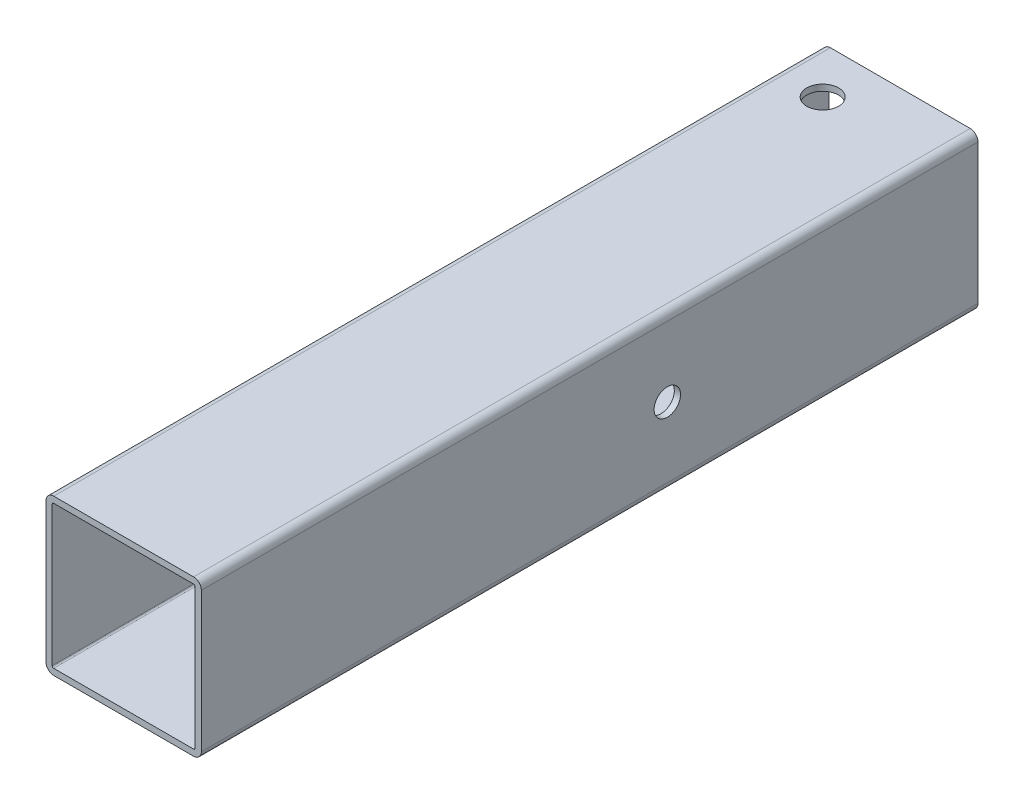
from build123d import *

# Parameters (mm, degrees)
BASE_EXTRUSION_DEPTH    = 500
ESQUISSE2_R             = 8.5
ENL_V_MAT_EXTRU_1_DEPTH = 520.615242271
ESQUISSE3_R             = 3.25
ENL_V_MAT_EXTRU_2_DEPTH = 10
ESQUISSE4_R             = 10.25
ENL_V_MAT_EXTRU_3_DEPTH = 520.615242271


with BuildPart() as part:
    # Esquisse1 → Base-Extrusion (new body)
    with BuildSketch(Plane.XY):
        with BuildLine():
            Line((5, 0), (95, 0))
            ThreePointArc((95, 0), (98.535533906, -1.464466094), (100, -5))
            Line((100, -5), (100, -95))
            ThreePointArc((100, -95), (98.535533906, -98.535533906), (95, -100))
            Line((95, -100), (5, -100))
            ThreePointArc((5, -100), (1.464466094, -98.535533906), (0, -95))
            Line((0, -95), (0, -5))
            ThreePointArc((0, -5), (1.464466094, -1.464466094), (5, 0))
        make_face()
        with BuildLine():
            Line((5, -4), (95, -4))
            ThreePointArc((95, -4), (95.707106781, -4.292893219), (96, -5))
            Line((96, -5), (96, -95))
            ThreePointArc((96, -95), (95.707106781, -95.707106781), (95, -96))
            Line((95, -96), (5, -96))
            ThreePointArc((5, -96), (4.292893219, -95.707106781), (4, -95))
            Line((4, -95), (4, -5))
            ThreePointArc((4, -5), (4.292893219, -4.292893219), (5, -4))
        make_face(mode=Mode.SUBTRACT)
    extrude(amount=BASE_EXTRUSION_DEPTH)

    # Esquisse2 → Enl_v. mat.-Extru.1 (cut, through all)
    with BuildSketch(Plane.ZY):
        with Locations(Location((200, -50, 0), (0, 0, 270))):
            Circle(ESQUISSE2_R)
    extrude(amount=-ENL_V_MAT_EXTRU_1_DEPTH, mode=Mode.SUBTRACT)

    # Esquisse3 → Enl_v. mat.-Extru.2 (cut)
    with BuildSketch(Plane.ZY):
        with Locations(Location((30, -85, 0), (0, 0, 270))):
            Circle(ESQUISSE3_R)
    extrude(amount=-ENL_V_MAT_EXTRU_2_DEPTH, mode=Mode.SUBTRACT)

    # Esquisse4 → Enl_v. mat.-Extru.3 (cut, through all)
    with BuildSketch(Plane(origin=(0, 0, 0), x_dir=(-1, 0, 0), z_dir=(0, 1, 0))):
        with Locations(Location((-30, 30, 0), (0, 0, 90))):
            Circle(ESQUISSE4_R)
    extrude(amount=-ENL_V_MAT_EXTRU_3_DEPTH, mode=Mode.SUBTRACT)


solid = part.part
